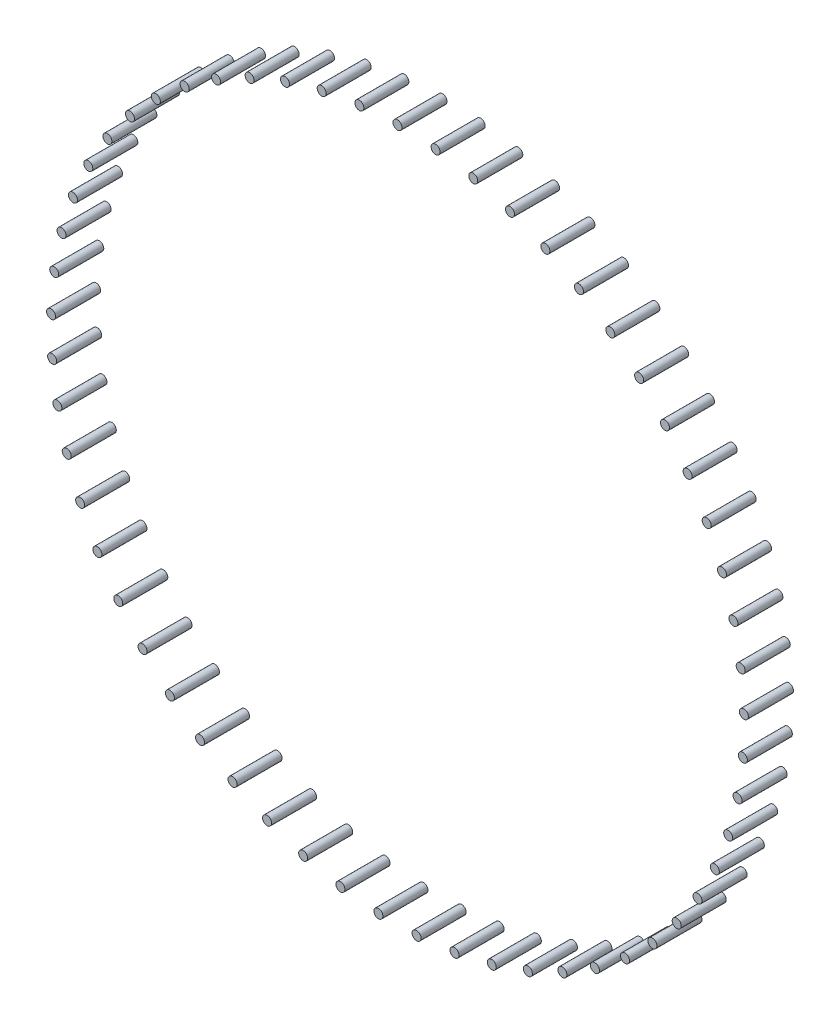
from build123d import *

# Parameters (mm, degrees)
ESQUISSE1_R           = 2.269
BOSS_EXTRU_1_DEPTH    = 22.71
BOSS_EXTRU_1_2_DEPTH  = 22.71
BOSS_EXTRU_1_3_DEPTH  = 22.71
BOSS_EXTRU_1_4_DEPTH  = 22.71
BOSS_EXTRU_1_5_DEPTH  = 22.71
BOSS_EXTRU_1_6_DEPTH  = 22.71
BOSS_EXTRU_1_7_DEPTH  = 22.71
BOSS_EXTRU_1_8_DEPTH  = 22.71
BOSS_EXTRU_1_9_DEPTH  = 22.71
BOSS_EXTRU_1_10_DEPTH = 22.71
BOSS_EXTRU_1_11_DEPTH = 22.71
BOSS_EXTRU_1_12_DEPTH = 22.71
BOSS_EXTRU_1_13_DEPTH = 22.71
BOSS_EXTRU_1_14_DEPTH = 22.71
BOSS_EXTRU_1_15_DEPTH = 22.71
BOSS_EXTRU_1_16_DEPTH = 22.71
BOSS_EXTRU_1_17_DEPTH = 22.71
BOSS_EXTRU_1_18_DEPTH = 22.71
BOSS_EXTRU_1_19_DEPTH = 22.71
BOSS_EXTRU_1_20_DEPTH = 22.71
BOSS_EXTRU_1_21_DEPTH = 22.71
BOSS_EXTRU_1_22_DEPTH = 22.71
BOSS_EXTRU_1_23_DEPTH = 22.71
BOSS_EXTRU_1_24_DEPTH = 22.71
BOSS_EXTRU_1_25_DEPTH = 22.71
BOSS_EXTRU_1_26_DEPTH = 22.71
BOSS_EXTRU_1_27_DEPTH = 22.71
BOSS_EXTRU_1_28_DEPTH = 22.71
BOSS_EXTRU_1_29_DEPTH = 22.71
BOSS_EXTRU_1_30_DEPTH = 22.71
BOSS_EXTRU_1_31_DEPTH = 22.71
BOSS_EXTRU_1_32_DEPTH = 22.71
BOSS_EXTRU_1_33_DEPTH = 22.71
BOSS_EXTRU_1_34_DEPTH = 22.71
BOSS_EXTRU_1_35_DEPTH = 22.71
BOSS_EXTRU_1_36_DEPTH = 22.71
BOSS_EXTRU_1_37_DEPTH = 22.71
BOSS_EXTRU_1_38_DEPTH = 22.71
BOSS_EXTRU_1_39_DEPTH = 22.71
BOSS_EXTRU_1_40_DEPTH = 22.71
BOSS_EXTRU_1_41_DEPTH = 22.71
BOSS_EXTRU_1_42_DEPTH = 22.71
BOSS_EXTRU_1_43_DEPTH = 22.71
BOSS_EXTRU_1_44_DEPTH = 22.71
BOSS_EXTRU_1_45_DEPTH = 22.71
BOSS_EXTRU_1_46_DEPTH = 22.71
BOSS_EXTRU_1_47_DEPTH = 22.71
BOSS_EXTRU_1_48_DEPTH = 22.71
BOSS_EXTRU_1_49_DEPTH = 22.71
BOSS_EXTRU_1_50_DEPTH = 22.71
BOSS_EXTRU_1_51_DEPTH = 22.71
BOSS_EXTRU_1_52_DEPTH = 22.71
BOSS_EXTRU_1_53_DEPTH = 22.71
BOSS_EXTRU_1_54_DEPTH = 22.71
BOSS_EXTRU_1_55_DEPTH = 22.71
BOSS_EXTRU_1_56_DEPTH = 22.71
BOSS_EXTRU_1_57_DEPTH = 22.71


with BuildPart() as part:
    # Esquisse1 → Boss.-Extru.1 (new body)
    with BuildSketch(Plane.XY):
        with Locations((-83.129209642, -153.609325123)):
            Circle(ESQUISSE1_R)
    extrude(amount=BOSS_EXTRU_1_DEPTH)


with BuildPart() as body_2:
    # Esquisse1 → Boss.-Extru.1 2 (new body)
    with BuildSketch(Plane.XY):
        with Locations((-99.522960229, -143.532124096)):
            Circle(ESQUISSE1_R)
    extrude(amount=BOSS_EXTRU_1_2_DEPTH)


with BuildPart() as body_3:
    # Esquisse1 → Boss.-Extru.1 3 (new body)
    with BuildSketch(Plane.XY):
        with Locations((-114.708636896, -131.712637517)):
            Circle(ESQUISSE1_R)
    extrude(amount=BOSS_EXTRU_1_3_DEPTH)


with BuildPart() as body_4:
    # Esquisse1 → Boss.-Extru.1 4 (new body)
    with BuildSketch(Plane.XY):
        with Locations((-128.5019061, -118.294337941)):
            Circle(ESQUISSE1_R)
    extrude(amount=BOSS_EXTRU_1_4_DEPTH)


with BuildPart() as body_5:
    # Esquisse1 → Boss.-Extru.1 5 (new body)
    with BuildSketch(Plane.XY):
        with Locations((-140.735336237, -103.440105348)):
            Circle(ESQUISSE1_R)
    extrude(amount=BOSS_EXTRU_1_5_DEPTH)


with BuildPart() as body_6:
    # Esquisse1 → Boss.-Extru.1 6 (new body)
    with BuildSketch(Plane.XY):
        with Locations((-151.260430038, -87.33025)):
            Circle(ESQUISSE1_R)
    extrude(amount=BOSS_EXTRU_1_6_DEPTH)


with BuildPart() as body_7:
    # Esquisse1 → Boss.-Extru.1 7 (new body)
    with BuildSketch(Plane.XY):
        with Locations((-159.94942712, -70.160323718)):
            Circle(ESQUISSE1_R)
    extrude(amount=BOSS_EXTRU_1_7_DEPTH)


with BuildPart() as body_8:
    # Esquisse1 → Boss.-Extru.1 8 (new body)
    with BuildSketch(Plane.XY):
        with Locations((-166.696854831, -52.138746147)):
            Circle(ESQUISSE1_R)
    extrude(amount=BOSS_EXTRU_1_8_DEPTH)


with BuildPart() as body_9:
    # Esquisse1 → Boss.-Extru.1 9 (new body)
    with BuildSketch(Plane.XY):
        with Locations((-171.420808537, -33.484274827)):
            Circle(ESQUISSE1_R)
    extrude(amount=BOSS_EXTRU_1_9_DEPTH)


with BuildPart() as body_10:
    # Esquisse1 → Boss.-Extru.1 10 (new body)
    with BuildSketch(Plane.XY):
        with Locations((-174.063945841, -14.42334977)):
            Circle(ESQUISSE1_R)
    extrude(amount=BOSS_EXTRU_1_10_DEPTH)


with BuildPart() as body_11:
    # Esquisse1 → Boss.-Extru.1 11 (new body)
    with BuildSketch(Plane.XY):
        with Locations((-174.594182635, 4.812655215)):
            Circle(ESQUISSE1_R)
    extrude(amount=BOSS_EXTRU_1_11_DEPTH)


with BuildPart() as body_12:
    # Esquisse1 → Boss.-Extru.1 12 (new body)
    with BuildSketch(Plane.XY):
        with Locations((-173.005082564, 23.990241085)):
            Circle(ESQUISSE1_R)
    extrude(amount=BOSS_EXTRU_1_12_DEPTH)


with BuildPart() as body_13:
    # Esquisse1 → Boss.-Extru.1 13 (new body)
    with BuildSketch(Plane.XY):
        with Locations((-169.315935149, 42.876617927)):
            Circle(ESQUISSE1_R)
    extrude(amount=BOSS_EXTRU_1_13_DEPTH)


with BuildPart() as body_14:
    # Esquisse1 → Boss.-Extru.1 14 (new body)
    with BuildSketch(Plane.XY):
        with Locations((-163.571521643, 61.242530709)):
            Circle(ESQUISSE1_R)
    extrude(amount=BOSS_EXTRU_1_14_DEPTH)


with BuildPart() as body_15:
    # Esquisse1 → Boss.-Extru.1 15 (new body)
    with BuildSketch(Plane.XY):
        with Locations((-155.841571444, 78.865042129)):
            Circle(ESQUISSE1_R)
    extrude(amount=BOSS_EXTRU_1_15_DEPTH)


with BuildPart() as body_16:
    # Esquisse1 → Boss.-Extru.1 16 (new body)
    with BuildSketch(Plane.XY):
        with Locations((-146.219915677, 95.530238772)):
            Circle(ESQUISSE1_R)
    extrude(amount=BOSS_EXTRU_1_16_DEPTH)


with BuildPart() as body_17:
    # Esquisse1 → Boss.-Extru.1 17 (new body)
    with BuildSketch(Plane.XY):
        with Locations((-134.823348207, 111.035827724)):
            Circle(ESQUISSE1_R)
    extrude(amount=BOSS_EXTRU_1_17_DEPTH)


with BuildPart() as body_18:
    # Esquisse1 → Boss.-Extru.1 18 (new body)
    with BuildSketch(Plane.XY):
        with Locations((-121.790207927, 125.193592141)):
            Circle(ESQUISSE1_R)
    extrude(amount=BOSS_EXTRU_1_18_DEPTH)


with BuildPart() as body_19:
    # Esquisse1 → Boss.-Extru.1 19 (new body)
    with BuildSketch(Plane.XY):
        with Locations((-107.278699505, 137.831675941)):
            Circle(ESQUISSE1_R)
    extrude(amount=BOSS_EXTRU_1_19_DEPTH)


with BuildPart() as body_20:
    # Esquisse1 → Boss.-Extru.1 20 (new body)
    with BuildSketch(Plane.XY):
        with Locations((-91.464972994, 148.796669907)):
            Circle(ESQUISSE1_R)
    extrude(amount=BOSS_EXTRU_1_20_DEPTH)


with BuildPart() as body_21:
    # Esquisse1 → Boss.-Extru.1 21 (new body)
    with BuildSketch(Plane.XY):
        with Locations((-74.540985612, 157.955473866)):
            Circle(ESQUISSE1_R)
    extrude(amount=BOSS_EXTRU_1_21_DEPTH)


with BuildPart() as body_22:
    # Esquisse1 → Boss.-Extru.1 22 (new body)
    with BuildSketch(Plane.XY):
        with Locations((-56.712171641, 165.196912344)):
            Circle(ESQUISSE1_R)
    extrude(amount=BOSS_EXTRU_1_22_DEPTH)


with BuildPart() as body_23:
    # Esquisse1 → Boss.-Extru.1 23 (new body)
    with BuildSketch(Plane.XY):
        with Locations((-38.194948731, 170.433084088)):
            Circle(ESQUISSE1_R)
    extrude(amount=BOSS_EXTRU_1_23_DEPTH)


with BuildPart() as body_24:
    # Esquisse1 → Boss.-Extru.1 24 (new body)
    with BuildSketch(Plane.XY):
        with Locations((-19.214090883, 173.600429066)):
            Circle(ESQUISSE1_R)
    extrude(amount=BOSS_EXTRU_1_24_DEPTH)


with BuildPart() as body_25:
    # Esquisse1 → Boss.-Extru.1 25 (new body)
    with BuildSketch(Plane.XY):
        with Locations((0, 174.6605)):
            Circle(ESQUISSE1_R)
    extrude(amount=BOSS_EXTRU_1_25_DEPTH)


with BuildPart() as body_26:
    # Esquisse1 → Boss.-Extru.1 26 (new body)
    with BuildSketch(Plane.XY):
        with Locations((19.214090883, 173.600429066)):
            Circle(ESQUISSE1_R)
    extrude(amount=BOSS_EXTRU_1_26_DEPTH)


with BuildPart() as body_27:
    # Esquisse1 → Boss.-Extru.1 27 (new body)
    with BuildSketch(Plane.XY):
        with Locations((38.194948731, 170.433084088)):
            Circle(ESQUISSE1_R)
    extrude(amount=BOSS_EXTRU_1_27_DEPTH)


with BuildPart() as body_28:
    # Esquisse1 → Boss.-Extru.1 28 (new body)
    with BuildSketch(Plane.XY):
        with Locations((56.712171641, 165.196912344)):
            Circle(ESQUISSE1_R)
    extrude(amount=BOSS_EXTRU_1_28_DEPTH)


with BuildPart() as body_29:
    # Esquisse1 → Boss.-Extru.1 29 (new body)
    with BuildSketch(Plane.XY):
        with Locations((74.540985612, 157.955473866)):
            Circle(ESQUISSE1_R)
    extrude(amount=BOSS_EXTRU_1_29_DEPTH)


with BuildPart() as body_30:
    # Esquisse1 → Boss.-Extru.1 30 (new body)
    with BuildSketch(Plane.XY):
        with Locations((91.464972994, 148.796669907)):
            Circle(ESQUISSE1_R)
    extrude(amount=BOSS_EXTRU_1_30_DEPTH)


with BuildPart() as body_31:
    # Esquisse1 → Boss.-Extru.1 31 (new body)
    with BuildSketch(Plane.XY):
        with Locations((107.278699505, 137.831675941)):
            Circle(ESQUISSE1_R)
    extrude(amount=BOSS_EXTRU_1_31_DEPTH)


with BuildPart() as body_32:
    # Esquisse1 → Boss.-Extru.1 32 (new body)
    with BuildSketch(Plane.XY):
        with Locations((121.790207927, 125.193592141)):
            Circle(ESQUISSE1_R)
    extrude(amount=BOSS_EXTRU_1_32_DEPTH)


with BuildPart() as body_33:
    # Esquisse1 → Boss.-Extru.1 33 (new body)
    with BuildSketch(Plane.XY):
        with Locations((134.823348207, 111.035827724)):
            Circle(ESQUISSE1_R)
    extrude(amount=BOSS_EXTRU_1_33_DEPTH)


with BuildPart() as body_34:
    # Esquisse1 → Boss.-Extru.1 34 (new body)
    with BuildSketch(Plane.XY):
        with Locations((146.219915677, 95.530238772)):
            Circle(ESQUISSE1_R)
    extrude(amount=BOSS_EXTRU_1_34_DEPTH)


with BuildPart() as body_35:
    # Esquisse1 → Boss.-Extru.1 35 (new body)
    with BuildSketch(Plane.XY):
        with Locations((155.841571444, 78.865042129)):
            Circle(ESQUISSE1_R)
    extrude(amount=BOSS_EXTRU_1_35_DEPTH)


with BuildPart() as body_36:
    # Esquisse1 → Boss.-Extru.1 36 (new body)
    with BuildSketch(Plane.XY):
        with Locations((163.571521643, 61.242530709)):
            Circle(ESQUISSE1_R)
    extrude(amount=BOSS_EXTRU_1_36_DEPTH)


with BuildPart() as body_37:
    # Esquisse1 → Boss.-Extru.1 37 (new body)
    with BuildSketch(Plane.XY):
        with Locations((169.315935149, 42.876617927)):
            Circle(ESQUISSE1_R)
    extrude(amount=BOSS_EXTRU_1_37_DEPTH)


with BuildPart() as body_38:
    # Esquisse1 → Boss.-Extru.1 38 (new body)
    with BuildSketch(Plane.XY):
        with Locations((173.005082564, 23.990241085)):
            Circle(ESQUISSE1_R)
    extrude(amount=BOSS_EXTRU_1_38_DEPTH)


with BuildPart() as body_39:
    # Esquisse1 → Boss.-Extru.1 39 (new body)
    with BuildSketch(Plane.XY):
        with Locations((174.594182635, 4.812655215)):
            Circle(ESQUISSE1_R)
    extrude(amount=BOSS_EXTRU_1_39_DEPTH)


with BuildPart() as body_40:
    # Esquisse1 → Boss.-Extru.1 40 (new body)
    with BuildSketch(Plane.XY):
        with Locations((174.063945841, -14.42334977)):
            Circle(ESQUISSE1_R)
    extrude(amount=BOSS_EXTRU_1_40_DEPTH)


with BuildPart() as body_41:
    # Esquisse1 → Boss.-Extru.1 41 (new body)
    with BuildSketch(Plane.XY):
        with Locations((171.420808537, -33.484274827)):
            Circle(ESQUISSE1_R)
    extrude(amount=BOSS_EXTRU_1_41_DEPTH)


with BuildPart() as body_42:
    # Esquisse1 → Boss.-Extru.1 42 (new body)
    with BuildSketch(Plane.XY):
        with Locations((166.696854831, -52.138746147)):
            Circle(ESQUISSE1_R)
    extrude(amount=BOSS_EXTRU_1_42_DEPTH)


with BuildPart() as body_43:
    # Esquisse1 → Boss.-Extru.1 43 (new body)
    with BuildSketch(Plane.XY):
        with Locations((159.94942712, -70.160323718)):
            Circle(ESQUISSE1_R)
    extrude(amount=BOSS_EXTRU_1_43_DEPTH)


with BuildPart() as body_44:
    # Esquisse1 → Boss.-Extru.1 44 (new body)
    with BuildSketch(Plane.XY):
        with Locations((151.260430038, -87.33025)):
            Circle(ESQUISSE1_R)
    extrude(amount=BOSS_EXTRU_1_44_DEPTH)


with BuildPart() as body_45:
    # Esquisse1 → Boss.-Extru.1 45 (new body)
    with BuildSketch(Plane.XY):
        with Locations((140.735336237, -103.440105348)):
            Circle(ESQUISSE1_R)
    extrude(amount=BOSS_EXTRU_1_45_DEPTH)


with BuildPart() as body_46:
    # Esquisse1 → Boss.-Extru.1 46 (new body)
    with BuildSketch(Plane.XY):
        with Locations((128.5019061, -118.294337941)):
            Circle(ESQUISSE1_R)
    extrude(amount=BOSS_EXTRU_1_46_DEPTH)


with BuildPart() as body_47:
    # Esquisse1 → Boss.-Extru.1 47 (new body)
    with BuildSketch(Plane.XY):
        with Locations((114.708636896, -131.712637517)):
            Circle(ESQUISSE1_R)
    extrude(amount=BOSS_EXTRU_1_47_DEPTH)


with BuildPart() as body_48:
    # Esquisse1 → Boss.-Extru.1 48 (new body)
    with BuildSketch(Plane.XY):
        with Locations((99.522960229, -143.532124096)):
            Circle(ESQUISSE1_R)
    extrude(amount=BOSS_EXTRU_1_48_DEPTH)


with BuildPart() as body_49:
    # Esquisse1 → Boss.-Extru.1 49 (new body)
    with BuildSketch(Plane.XY):
        with Locations((83.129209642, -153.609325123)):
            Circle(ESQUISSE1_R)
    extrude(amount=BOSS_EXTRU_1_49_DEPTH)


with BuildPart() as body_50:
    # Esquisse1 → Boss.-Extru.1 50 (new body)
    with BuildSketch(Plane.XY):
        with Locations((65.726383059, -161.821917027)):
            Circle(ESQUISSE1_R)
    extrude(amount=BOSS_EXTRU_1_50_DEPTH)


with BuildPart() as body_51:
    # Esquisse1 → Boss.-Extru.1 51 (new body)
    with BuildSketch(Plane.XY):
        with Locations((47.525727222, -168.070210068)):
            Circle(ESQUISSE1_R)
    extrude(amount=BOSS_EXTRU_1_51_DEPTH)


with BuildPart() as body_52:
    # Esquisse1 → Boss.-Extru.1 52 (new body)
    with BuildSketch(Plane.XY):
        with Locations((28.748173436, -172.278358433)):
            Circle(ESQUISSE1_R)
    extrude(amount=BOSS_EXTRU_1_52_DEPTH)


with BuildPart() as body_53:
    # Esquisse1 → Boss.-Extru.1 53 (new body)
    with BuildSketch(Plane.XY):
        with Locations((9.621655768, -174.395280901)):
            Circle(ESQUISSE1_R)
    extrude(amount=BOSS_EXTRU_1_53_DEPTH)


with BuildPart() as body_54:
    # Esquisse1 → Boss.-Extru.1 54 (new body)
    with BuildSketch(Plane.XY):
        with Locations((-9.621655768, -174.395280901)):
            Circle(ESQUISSE1_R)
    extrude(amount=BOSS_EXTRU_1_54_DEPTH)


with BuildPart() as body_55:
    # Esquisse1 → Boss.-Extru.1 55 (new body)
    with BuildSketch(Plane.XY):
        with Locations((-28.748173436, -172.278358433)):
            Circle(ESQUISSE1_R)
    extrude(amount=BOSS_EXTRU_1_55_DEPTH)


with BuildPart() as body_56:
    # Esquisse1 → Boss.-Extru.1 56 (new body)
    with BuildSketch(Plane.XY):
        with Locations((-47.525727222, -168.070210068)):
            Circle(ESQUISSE1_R)
    extrude(amount=BOSS_EXTRU_1_56_DEPTH)


with BuildPart() as body_57:
    # Esquisse1 → Boss.-Extru.1 57 (new body)
    with BuildSketch(Plane.XY):
        with Locations((-65.726383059, -161.821917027)):
            Circle(ESQUISSE1_R)
    extrude(amount=BOSS_EXTRU_1_57_DEPTH)


solid = Compound([part.part, body_2.part, body_3.part, body_4.part, body_5.part, body_6.part, body_7.part, body_8.part, body_9.part, body_10.part, body_11.part, body_12.part, body_13.part, body_14.part, body_15.part, body_16.part, body_17.part, body_18.part, body_19.part, body_20.part, body_21.part, body_22.part, body_23.part, body_24.part, body_25.part, body_26.part, body_27.part, body_28.part, body_29.part, body_30.part, body_31.part, body_32.part, body_33.part, body_34.part, body_35.part, body_36.part, body_37.part, body_38.part, body_39.part, body_40.part, body_41.part, body_42.part, body_43.part, body_44.part, body_45.part, body_46.part, body_47.part, body_48.part, body_49.part, body_50.part, body_51.part, body_52.part, body_53.part, body_54.part, body_55.part, body_56.part, body_57.part])
